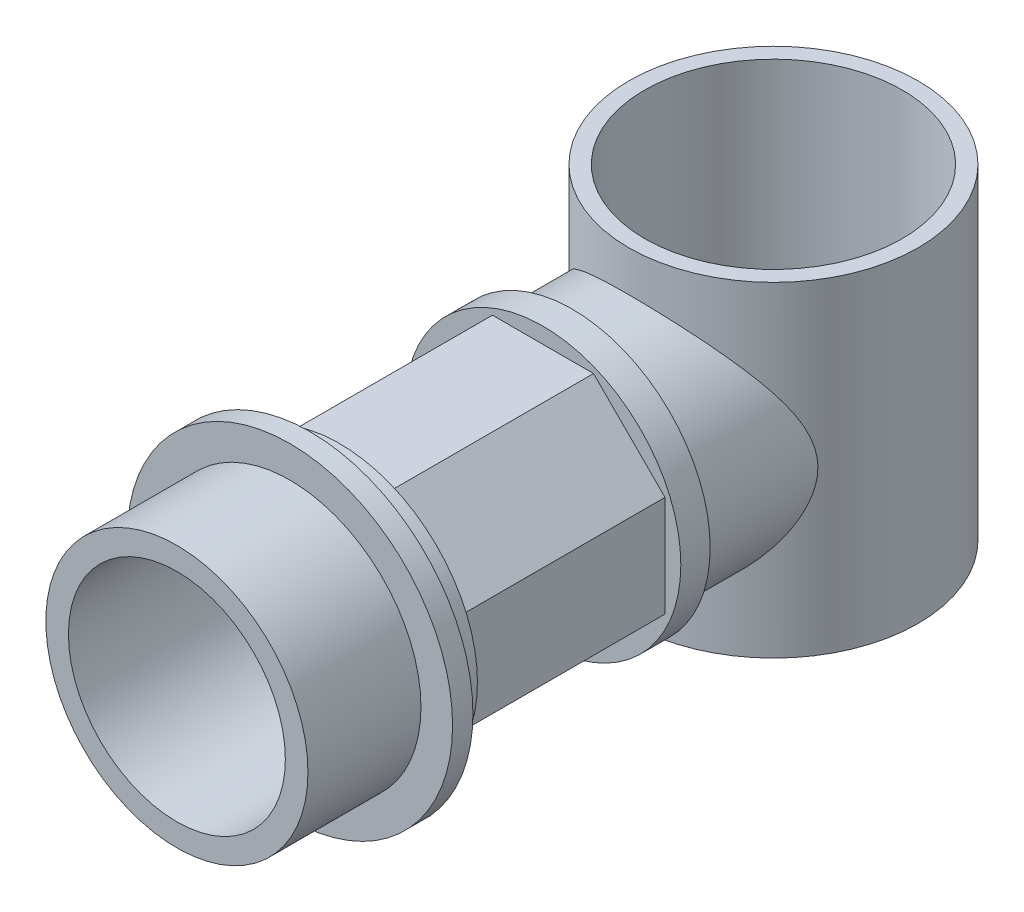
from build123d import *

# Parameters (mm, degrees)
SKIZZE1_R                            = 29
SKIZZE1_R_2                          = 24
LINEAR_AUSTRAGEN1_DEPTH              = 25
SKIZZE2_R                            = 36
SKIZZE2_R_2                          = 24
LINEAR_AUSTRAGEN2_DEPTH              = 4.5
SKIZZE3_R                            = 30.5
SKIZZE3_R_2                          = 24
LINEAR_AUSTRAGEN3_DEPTH              = 6.5
SKIZZE4_R                            = 24
LINEAR_AUSTRAGEN4_DEPTH              = 45
SKIZZE5_R                            = 30.5
SKIZZE5_R_2                          = 24
LINEAR_AUSTRAGEN5_DEPTH              = 6.5
SKIZZE6_R                            = 27
SKIZZE6_R_2                          = 24
LINEAR_AUSTRAGEN6_DEPTH              = 50
LINEAR_AUSTRAGEN7_DEPTH              = 36
LINEAR_AUSTRAGEN7_DEPTH_BACK         = 36
SKIZZE7_R                            = 32
SKIZZE7_R_2                          = 28.5
SCHNITT_LINEAR_AUSTRAGEN1_DEPTH      = 172.720703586
SCHNITT_LINEAR_AUSTRAGEN1_DEPTH_BACK = 172.720703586
SKIZZE8_R                            = 28.5
SCHNITT_LINEAR_AUSTRAGEN2_REACH      = 173.721
SKIZZE9_R                            = 24


with BuildPart() as part:
    # Skizze1 → Linear austragen1 (new body)
    with BuildSketch(Plane.XY):
        Circle(SKIZZE1_R)
        Circle(SKIZZE1_R_2, mode=Mode.SUBTRACT)
    extrude(amount=-LINEAR_AUSTRAGEN1_DEPTH)

    # Skizze2 → Linear austragen2 (add)
    with BuildSketch(Plane(origin=(0, 0, -25), x_dir=(-1, 0, 0), z_dir=(0, 0, -1))):
        Circle(SKIZZE2_R)
        with Locations(Location((0, 0, 0), (0, 0, 180))):
            Circle(SKIZZE2_R_2, mode=Mode.SUBTRACT)
    extrude(amount=LINEAR_AUSTRAGEN2_DEPTH)

    # Skizze3 → Linear austragen3 (add)
    with BuildSketch(Plane(origin=(0, 0, -29.5), x_dir=(-1, 0, 0), z_dir=(0, 0, -1))):
        with Locations(Location((0, 0, 0), (0, 0, 180))):
            Circle(SKIZZE3_R)
        with Locations(Location((0, 0, 0), (0, 0, 180))):
            Circle(SKIZZE3_R_2, mode=Mode.SUBTRACT)
    extrude(amount=LINEAR_AUSTRAGEN3_DEPTH)

    # Skizze4 → Linear austragen4 (add)
    with BuildSketch(Plane(origin=(0, 0, -36), x_dir=(-1, 0, 0), z_dir=(0, 0, -1))):
        Polygon((11.183766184, -27), (27, -11.183766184), (27, 11.183766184), (11.183766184, 27), (-11.183766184, 27), (-27, 11.183766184), (-27, -11.183766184), (-11.183766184, -27), align=None)
        with Locations(Location((0, 0, 0), (0, 0, 180))):
            Circle(SKIZZE4_R, mode=Mode.SUBTRACT)
    extrude(amount=LINEAR_AUSTRAGEN4_DEPTH)

    # Skizze5 → Linear austragen5 (add)
    with BuildSketch(Plane(origin=(0, 0, -81), x_dir=(-1, 0, 0), z_dir=(0, 0, -1))):
        with Locations(Location((0, 0, 0), (0, 0, 180))):
            Circle(SKIZZE5_R)
        with Locations(Location((0, 0, 0), (0, 0, 180))):
            Circle(SKIZZE5_R_2, mode=Mode.SUBTRACT)
    extrude(amount=LINEAR_AUSTRAGEN5_DEPTH)

    # Skizze6 → Linear austragen6 (add)
    with BuildSketch(Plane(origin=(0, 0, -87.5), x_dir=(-1, 0, 0), z_dir=(0, 0, -1))):
        Circle(SKIZZE6_R)
        with Locations(Location((0, 0, 0), (0, 0, 180))):
            Circle(SKIZZE6_R_2, mode=Mode.SUBTRACT)
    extrude(amount=LINEAR_AUSTRAGEN6_DEPTH)

    # Skizze7 → Linear austragen7 (add, two sides: drawn at the far end of the back side and taken through both)
    with BuildSketch(Plane(origin=(0, 0, 0), x_dir=(1, 0, 0), z_dir=(0, 1, 0)).offset(-LINEAR_AUSTRAGEN7_DEPTH_BACK)):
        with Locations(Location((0, 132, 0), (0, 0, 270))):
            Circle(SKIZZE7_R)
        with Locations(Location((0, 132, 0), (0, 0, 270))):
            Circle(SKIZZE7_R_2, mode=Mode.SUBTRACT)
    extrude(amount=LINEAR_AUSTRAGEN7_DEPTH + LINEAR_AUSTRAGEN7_DEPTH_BACK)

    # Skizze8 → Schnitt-Linear austragen1 (cut, two sides: drawn at the far end of the back side and taken through both)
    with BuildSketch(Plane(origin=(0, 0, 0), x_dir=(1, 0, 0), z_dir=(0, 1, 0)).offset(-SCHNITT_LINEAR_AUSTRAGEN1_DEPTH_BACK)):
        with Locations(Location((0, 132, 0), (0, 0, 270))):
            Circle(SKIZZE8_R)
    extrude(amount=SCHNITT_LINEAR_AUSTRAGEN1_DEPTH + SCHNITT_LINEAR_AUSTRAGEN1_DEPTH_BACK, mode=Mode.SUBTRACT)

    # Skizze9 → Schnitt-Linear austragen2 (cut, up to next)
    with BuildSketch(Plane.XY, mode=Mode.PRIVATE) as schnitt_linear_austragen2_sk1:
        Circle(SKIZZE9_R)
    schnitt_linear_austragen2_tool1 = extrude(schnitt_linear_austragen2_sk1.sketch, amount=-SCHNITT_LINEAR_AUSTRAGEN2_REACH, mode=Mode.PRIVATE) & part.part
    add(schnitt_linear_austragen2_tool1.solids().sort_by_distance((0, 0, 0))[0], mode=Mode.SUBTRACT)


solid = part.part
